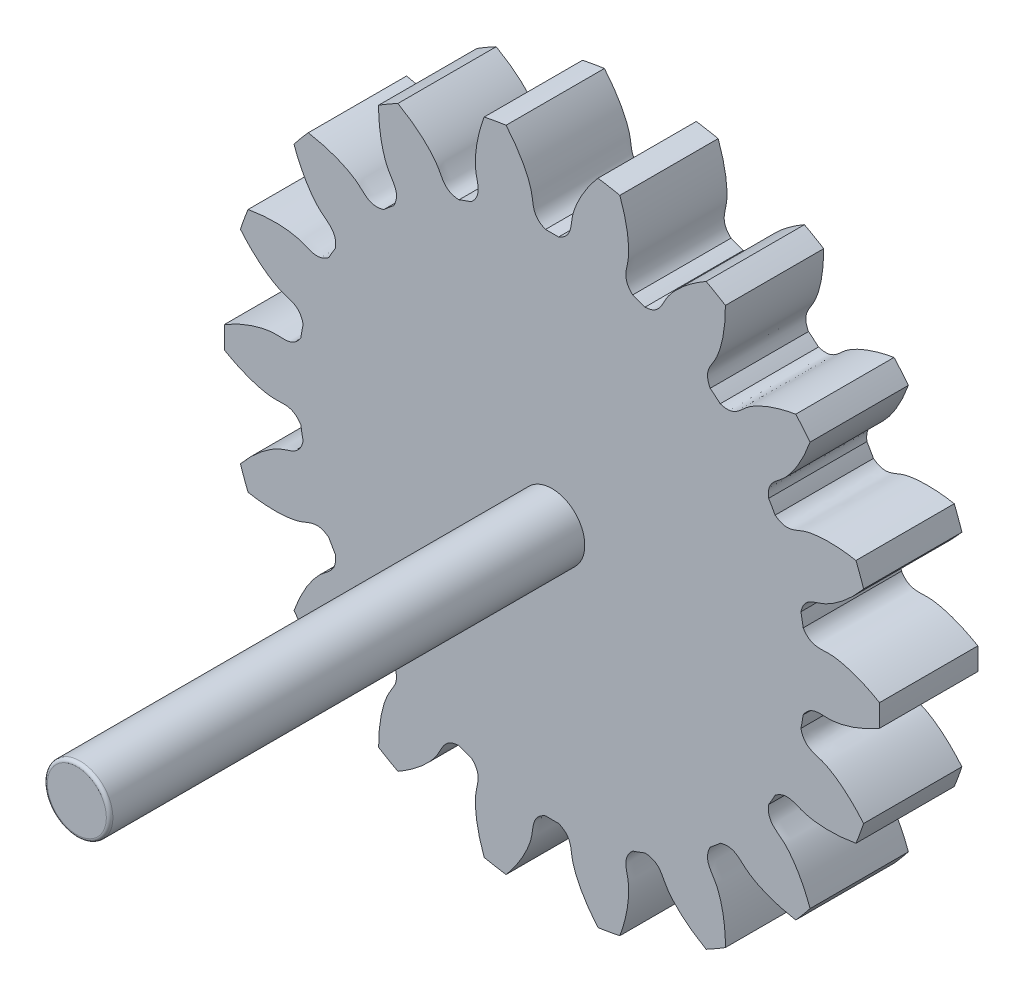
from build123d import *

# Parameters (mm, degrees)
SKETCH_1_R               = 20
EXTRUDE_1_DEPTH          = 6
CUT_EXTRUDE_1_DEPTH      = 29.91366459
PATTERN_CIRCULAR_1_COUNT = 18
SKETCH_4_R               = 2
EXTRUDE_2_DEPTH          = 29
FILLET_1_R               = 0.2


with BuildPart() as part:
    # Sketch 1 → Extrude 1 (new body)
    with BuildSketch(Plane.XY):
        Circle(SKETCH_1_R)
    extrude(amount=EXTRUDE_1_DEPTH)

    # Sketch 2 → Cut-Extrude 1 (cut, through all)
    with BuildSketch(Plane.XY):
        with BuildLine():
            ThreePointArc((0.398807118, 15.494868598), (0, 15.5), (-0.398807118, 15.494868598))
            add(Edge.make_bspline(
                [(-0.398807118, 15.494868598), (-1.23020808, 15.837360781), (-1.1255781, 16.477399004), (-1.263665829, 17.085190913), (-1.27750304, 17.141013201), (-1.294215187, 17.203080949), (-1.314049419, 17.271300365), (-1.337260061, 17.345568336), (-1.364095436, 17.425774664), (-1.394801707, 17.511801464), (-1.429621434, 17.603523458), (-1.46879375, 17.700807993), (-1.512554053, 17.803515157), (-1.561133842, 17.911497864), (-1.614760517, 18.02460196), (-1.673657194, 18.142666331), (-1.738042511, 18.265523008), (-1.80813045, 18.392997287), (-1.884130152, 18.524907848), (-1.96624574, 18.661066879), (-2.054676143, 18.801280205), (-2.149614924, 18.945347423), (-2.25125011, 19.09306204), (-2.359764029, 19.244211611), (-2.475333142, 19.398577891), (-2.598127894, 19.555936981), (-2.728312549, 19.716059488), (-2.866045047, 19.878710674), (-3.011476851, 20.043650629), (-3.164752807, 20.210634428), (-3.326011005, 20.379412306), (-3.495382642, 20.549729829), (-3.672991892, 20.72132807), (-3.858955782, 20.893943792), (-4.053384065, 21.067309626), (-4.256379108, 21.241154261), (-4.468035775, 21.415202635), (-4.68844132, 21.58917612), (-4.917675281, 21.762792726), (-5.155809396, 21.935767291), (-5.402907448, 22.107811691), (-5.748150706, 22.338079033), (-6.015110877, 22.504667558), (-6.197121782, 22.613356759)],
                knots=[0, 0, 0, 0, 0.187591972, 0.192996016, 0.1991206, 0.205965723, 0.213531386, 0.221817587, 0.230824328, 0.240551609, 0.250999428, 0.262167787, 0.274056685, 0.286666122, 0.299996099, 0.314046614, 0.32881767, 0.344309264, 0.360521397, 0.37745407, 0.395107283, 0.413481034, 0.432575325, 0.452390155, 0.472925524, 0.494181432, 0.51615788, 0.538854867, 0.562272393, 0.586410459, 0.611269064, 0.636848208, 0.663147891, 0.690168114, 0.717908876, 0.746370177, 0.775552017, 0.805454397, 0.836077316, 0.867420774, 0.899484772, 0.932269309, 1, 1, 1, 1], degree=3))
            ThreePointArc((-6.197121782, 22.613356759), (0, 23.447136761), (6.197121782, 22.613356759))
            add(Edge.make_bspline(
                [(0.398807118, 15.494868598), (1.23020808, 15.837360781), (1.1255781, 16.477399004), (1.263665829, 17.085190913), (1.27750304, 17.141013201), (1.294215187, 17.203080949), (1.314049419, 17.271300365), (1.337260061, 17.345568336), (1.364095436, 17.425774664), (1.394801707, 17.511801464), (1.429621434, 17.603523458), (1.46879375, 17.700807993), (1.512554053, 17.803515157), (1.561133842, 17.911497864), (1.614760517, 18.02460196), (1.673657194, 18.142666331), (1.738042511, 18.265523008), (1.80813045, 18.392997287), (1.884130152, 18.524907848), (1.96624574, 18.661066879), (2.054676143, 18.801280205), (2.149614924, 18.945347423), (2.25125011, 19.09306204), (2.359764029, 19.244211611), (2.475333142, 19.398577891), (2.598127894, 19.555936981), (2.728312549, 19.716059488), (2.866045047, 19.878710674), (3.011476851, 20.043650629), (3.164752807, 20.210634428), (3.326011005, 20.379412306), (3.495382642, 20.549729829), (3.672991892, 20.72132807), (3.858955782, 20.893943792), (4.053384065, 21.067309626), (4.256379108, 21.241154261), (4.468035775, 21.415202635), (4.68844132, 21.58917612), (4.917675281, 21.762792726), (5.155809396, 21.935767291), (5.402907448, 22.107811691), (5.748150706, 22.338079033), (6.015110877, 22.504667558), (6.197121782, 22.613356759)],
                knots=[0, 0, 0, 0, 0.187591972, 0.192996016, 0.1991206, 0.205965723, 0.213531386, 0.221817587, 0.230824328, 0.240551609, 0.250999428, 0.262167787, 0.274056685, 0.286666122, 0.299996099, 0.314046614, 0.32881767, 0.344309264, 0.360521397, 0.37745407, 0.395107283, 0.413481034, 0.432575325, 0.452390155, 0.472925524, 0.494181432, 0.51615788, 0.538854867, 0.562272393, 0.586410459, 0.611269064, 0.636848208, 0.663147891, 0.690168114, 0.717908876, 0.746370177, 0.775552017, 0.805454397, 0.836077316, 0.867420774, 0.899484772, 0.932269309, 1, 1, 1, 1], degree=3))
        make_face()
    cut_extrude_1 = extrude(amount=CUT_EXTRUDE_1_DEPTH, mode=Mode.SUBTRACT)

    # Pattern Circular 1: Cut-Extrude 1 ×18 about axis
    pattern_circular_1_axis = Axis((0, 0, 6), (0, 0, -1))
    for i in range(1, PATTERN_CIRCULAR_1_COUNT):
        add(cut_extrude_1.rotate(pattern_circular_1_axis, i * 360 / PATTERN_CIRCULAR_1_COUNT), mode=Mode.SUBTRACT)

    # Sketch 4 → Extrude 2 (add)
    with BuildSketch(Plane.XY.offset(6)):
        with Locations(Location((0, 0, 0), (0, 0, 180))):
            Circle(SKETCH_4_R)
    extrude(amount=EXTRUDE_2_DEPTH)

    # Fillet 1
    fillet_1_edges = [part.edges().sort_by_distance(p)[0] for p in [
        (2, 0, 35),
    ]]
    fillet(fillet_1_edges, radius=FILLET_1_R)


solid = part.part
